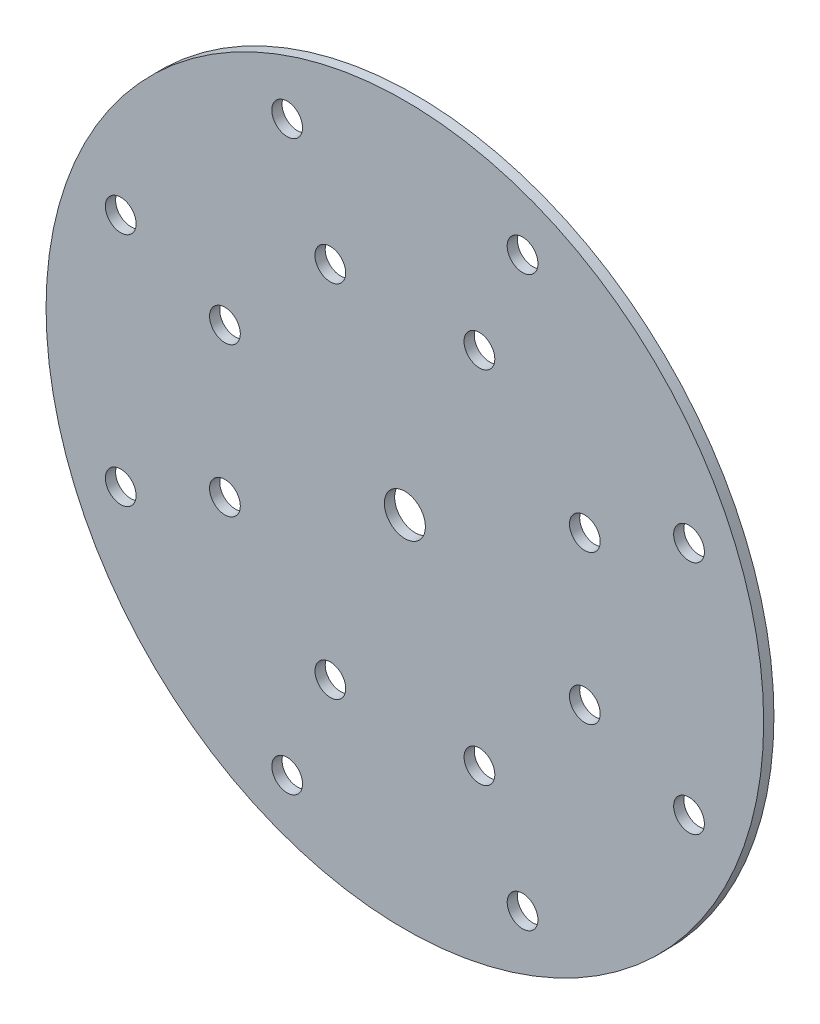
from build123d import *

# Parameters (mm, degrees)
SKETCH1_R                = 35
BOSS_EXTRUDE1_DEPTH      = 1
SKETCH2_R                = 2
CUT_EXTRUDE1_DEPTH       = 1
F_3_0_3_DIAMETER_HOLE1_D = 3
CIRPATTERN1_COUNT        = 8
F_3_0_3_DIAMETER_HOLE2_D = 3
CIRPATTERN2_COUNT        = 8


with BuildPart() as part:
    # Sketch1 → Boss-Extrude1 (new body)
    with BuildSketch(Plane.XY):
        Circle(SKETCH1_R)
    extrude(amount=BOSS_EXTRUDE1_DEPTH)

    # Sketch2 → Cut-Extrude1 (cut)
    with BuildSketch(Plane.XY.offset(1)):
        Circle(SKETCH2_R)
    extrude(amount=-CUT_EXTRUDE1_DEPTH, mode=Mode.SUBTRACT)

    # 3.0 _3_ Diameter Hole1 (through all)
    with Locations(Plane.XY.offset(1)):
        with Locations((-11.4805, 27.716387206)):
            f_3_0_3_diameter_hole1 = Hole(F_3_0_3_DIAMETER_HOLE1_D / 2)

    # CirPattern1: 3.0 _3_ Diameter Hole1 ×8 about axis
    cirpattern1_axis = Axis((0, 0, 0), (0, 0, 1))
    for i in range(1, CIRPATTERN1_COUNT):
        add(f_3_0_3_diameter_hole1.rotate(cirpattern1_axis, i * 360 / CIRPATTERN1_COUNT), mode=Mode.SUBTRACT)

    # 3.0 _3_ Diameter Hole2 (through all)
    with Locations(Plane(origin=(0, 0, 0), x_dir=(-1, 0, 0), z_dir=(0, 0, -1))):
        with Locations((-7.27, 17.554119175)):
            f_3_0_3_diameter_hole2 = Hole(F_3_0_3_DIAMETER_HOLE2_D / 2)

    # CirPattern2: 3.0 _3_ Diameter Hole2 ×8 about axis
    cirpattern2_axis = Axis((0, 0, 0), (0, 0, 1))
    for i in range(1, CIRPATTERN2_COUNT):
        add(f_3_0_3_diameter_hole2.rotate(cirpattern2_axis, i * 360 / CIRPATTERN2_COUNT), mode=Mode.SUBTRACT)


solid = part.part
